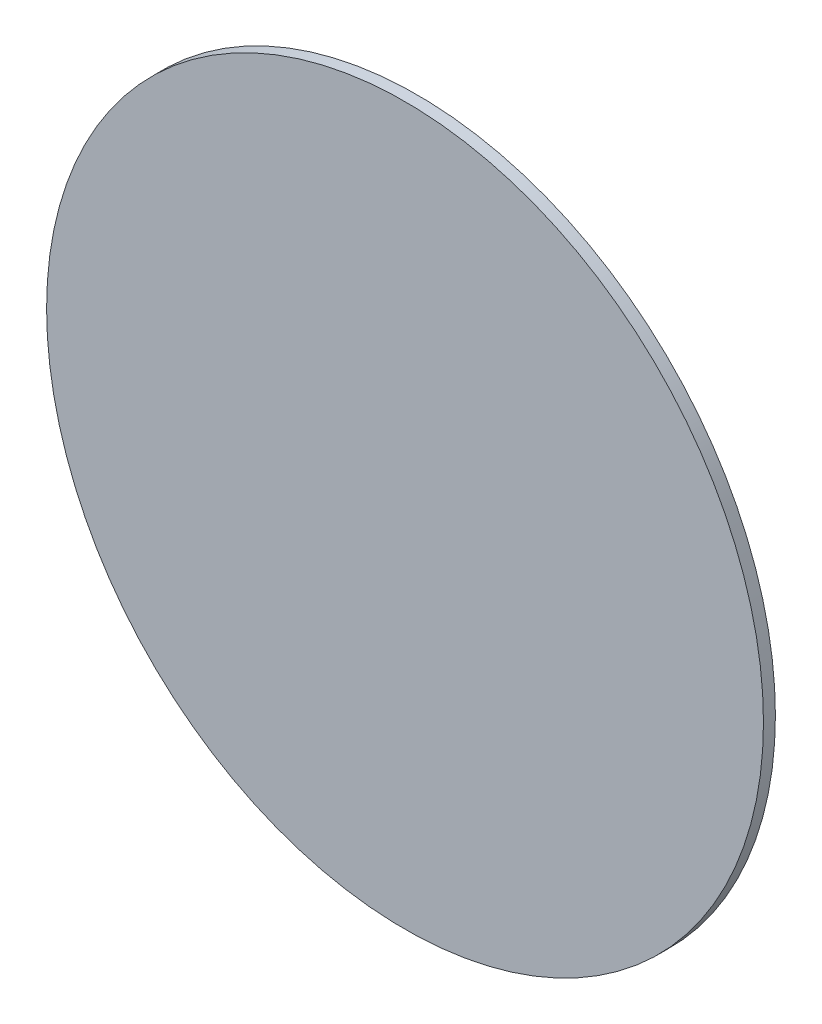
ISO-10303-21;
HEADER;
FILE_DESCRIPTION(('STEP AP214'),'2;1');
FILE_NAME('part.step','',(''),(''),'','','');
FILE_SCHEMA(('AUTOMOTIVE_DESIGN { 1 0 10303 214 1 1 1 1 }'));
ENDSEC;
DATA;
#1=APPLICATION_CONTEXT('core data for automotive mechanical design processes');
#2=APPLICATION_PROTOCOL_DEFINITION('international standard','automotive_design',2000,#1);
#3=PRODUCT_CONTEXT('',#1,'mechanical');
#4=PRODUCT('Part','Part','',(#3));
#5=PRODUCT_RELATED_PRODUCT_CATEGORY('part','',(#4));
#6=PRODUCT_DEFINITION_FORMATION('','',#4);
#7=PRODUCT_DEFINITION_CONTEXT('part definition',#1,'design');
#8=PRODUCT_DEFINITION('design','',#6,#7);
#9=PRODUCT_DEFINITION_SHAPE('','',#8);
#10=(LENGTH_UNIT() NAMED_UNIT(*) SI_UNIT(.MILLI.,.METRE.));
#11=(NAMED_UNIT(*) PLANE_ANGLE_UNIT() SI_UNIT($,.RADIAN.));
#12=(NAMED_UNIT(*) SI_UNIT($,.STERADIAN.) SOLID_ANGLE_UNIT());
#13=UNCERTAINTY_MEASURE_WITH_UNIT(LENGTH_MEASURE(1.E-05),#10,'distance_accuracy_value','');
#14=(GEOMETRIC_REPRESENTATION_CONTEXT(3) GLOBAL_UNCERTAINTY_ASSIGNED_CONTEXT((#13)) GLOBAL_UNIT_ASSIGNED_CONTEXT((#10,
#11,#12)) REPRESENTATION_CONTEXT('',''));
#15=CARTESIAN_POINT('',(0.,0.,0.));
#16=DIRECTION('',(0.,0.,1.));
#17=DIRECTION('',(1.,0.,0.));
#18=AXIS2_PLACEMENT_3D('',#15,#16,#17);
#19=CARTESIAN_POINT('',(0.,0.,12.7));
#20=DIRECTION('',(0.,0.,-1.));
#21=DIRECTION('',(-1.,0.,0.));
#22=AXIS2_PLACEMENT_3D('',#19,#20,#21);
#23=CYLINDRICAL_SURFACE('',#22,381.);
#24=CARTESIAN_POINT('',(0.,0.,12.7));
#25=DIRECTION('',(0.,0.,1.));
#26=DIRECTION('',(1.,0.,0.));
#27=AXIS2_PLACEMENT_3D('',#24,#25,#26);
#28=CIRCLE('',#27,381.);
#29=CARTESIAN_POINT('',(381.,0.,12.7));
#30=VERTEX_POINT('',#29);
#31=EDGE_CURVE('E10',#30,#30,#28,.T.);
#32=ORIENTED_EDGE('',*,*,#31,.F.);
#33=EDGE_LOOP('',(#32));
#34=FACE_BOUND('',#33,.T.);
#35=CARTESIAN_POINT('',(0.,0.,0.));
#36=DIRECTION('',(0.,0.,1.));
#37=DIRECTION('',(1.,0.,0.));
#38=AXIS2_PLACEMENT_3D('',#35,#36,#37);
#39=CIRCLE('',#38,381.);
#40=CARTESIAN_POINT('',(381.,0.,0.));
#41=VERTEX_POINT('',#40);
#42=EDGE_CURVE('E40',#41,#41,#39,.T.);
#43=ORIENTED_EDGE('',*,*,#42,.T.);
#44=EDGE_LOOP('',(#43));
#45=FACE_BOUND('',#44,.T.);
#46=ADVANCED_FACE('F37',(#34,#45),#23,.T.);
#47=CARTESIAN_POINT('',(0.,0.,12.7));
#48=DIRECTION('',(0.,0.,1.));
#49=DIRECTION('',(1.,0.,0.));
#50=AXIS2_PLACEMENT_3D('',#47,#48,#49);
#51=PLANE('',#50);
#52=ORIENTED_EDGE('',*,*,#31,.T.);
#53=EDGE_LOOP('',(#52));
#54=FACE_BOUND('',#53,.T.);
#55=ADVANCED_FACE('F54',(#54),#51,.T.);
#56=CARTESIAN_POINT('',(0.,0.,0.));
#57=DIRECTION('',(0.,0.,1.));
#58=DIRECTION('',(1.,0.,0.));
#59=AXIS2_PLACEMENT_3D('',#56,#57,#58);
#60=PLANE('',#59);
#61=ORIENTED_EDGE('',*,*,#42,.F.);
#62=EDGE_LOOP('',(#61));
#63=FACE_BOUND('',#62,.T.);
#64=ADVANCED_FACE('F52',(#63),#60,.F.);
#65=CLOSED_SHELL('',(#46,#55,#64));
#66=MANIFOLD_SOLID_BREP('B2',#65);
#67=ADVANCED_BREP_SHAPE_REPRESENTATION('',(#18,#66),#14);
#68=SHAPE_DEFINITION_REPRESENTATION(#9,#67);
ENDSEC;
END-ISO-10303-21;
